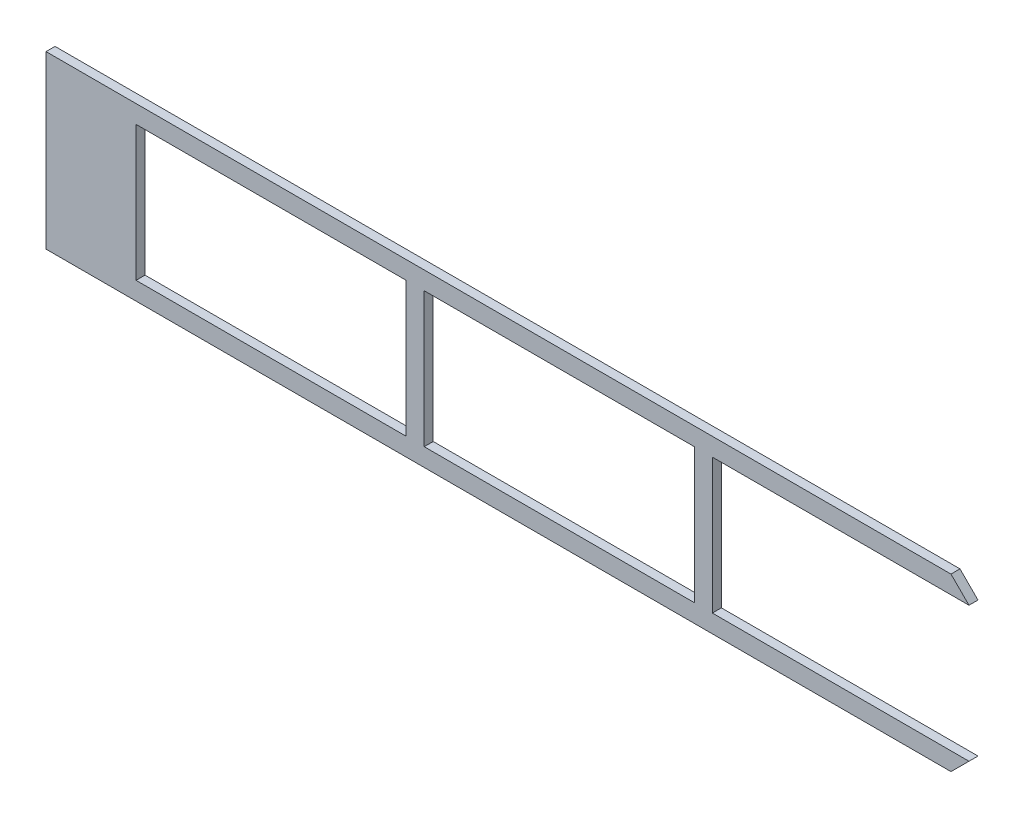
ISO-10303-21;
HEADER;
FILE_DESCRIPTION(('STEP AP214'),'2;1');
FILE_NAME('part.step','',(''),(''),'','','');
FILE_SCHEMA(('AUTOMOTIVE_DESIGN { 1 0 10303 214 1 1 1 1 }'));
ENDSEC;
DATA;
#1=APPLICATION_CONTEXT('core data for automotive mechanical design processes');
#2=APPLICATION_PROTOCOL_DEFINITION('international standard','automotive_design',2000,#1);
#3=PRODUCT_CONTEXT('',#1,'mechanical');
#4=PRODUCT('Part','Part','',(#3));
#5=PRODUCT_RELATED_PRODUCT_CATEGORY('part','',(#4));
#6=PRODUCT_DEFINITION_FORMATION('','',#4);
#7=PRODUCT_DEFINITION_CONTEXT('part definition',#1,'design');
#8=PRODUCT_DEFINITION('design','',#6,#7);
#9=PRODUCT_DEFINITION_SHAPE('','',#8);
#10=(LENGTH_UNIT() NAMED_UNIT(*) SI_UNIT(.MILLI.,.METRE.));
#11=(NAMED_UNIT(*) PLANE_ANGLE_UNIT() SI_UNIT($,.RADIAN.));
#12=(NAMED_UNIT(*) SI_UNIT($,.STERADIAN.) SOLID_ANGLE_UNIT());
#13=UNCERTAINTY_MEASURE_WITH_UNIT(LENGTH_MEASURE(1.E-05),#10,'distance_accuracy_value','');
#14=(GEOMETRIC_REPRESENTATION_CONTEXT(3) GLOBAL_UNCERTAINTY_ASSIGNED_CONTEXT((#13)) GLOBAL_UNIT_ASSIGNED_CONTEXT((#10,
#11,#12)) REPRESENTATION_CONTEXT('',''));
#15=CARTESIAN_POINT('',(0.,0.,0.));
#16=DIRECTION('',(0.,0.,1.));
#17=DIRECTION('',(1.,0.,0.));
#18=AXIS2_PLACEMENT_3D('',#15,#16,#17);
#19=CARTESIAN_POINT('',(0.,0.,1.));
#20=DIRECTION('',(0.,0.,-1.));
#21=DIRECTION('',(-1.,0.,0.));
#22=AXIS2_PLACEMENT_3D('',#19,#20,#21);
#23=PLANE('',#22);
#24=DIRECTION('',(0.,-1.,0.));
#25=VECTOR('',#24,1.);
#26=CARTESIAN_POINT('',(0.,0.,1.));
#27=LINE('',#26,#25);
#28=CARTESIAN_POINT('',(0.,15.,1.));
#29=VERTEX_POINT('',#28);
#30=CARTESIAN_POINT('',(0.,0.,1.));
#31=VERTEX_POINT('',#30);
#32=EDGE_CURVE('E186',#29,#31,#27,.T.);
#33=ORIENTED_EDGE('',*,*,#32,.F.);
#34=DIRECTION('',(-1.,0.,0.));
#35=VECTOR('',#34,1.);
#36=CARTESIAN_POINT('',(0.,15.,1.));
#37=LINE('',#36,#35);
#38=CARTESIAN_POINT('',(30.,15.,1.));
#39=VERTEX_POINT('',#38);
#40=EDGE_CURVE('E194',#39,#29,#37,.T.);
#41=ORIENTED_EDGE('',*,*,#40,.F.);
#42=DIRECTION('',(0.,1.,0.));
#43=VECTOR('',#42,1.);
#44=CARTESIAN_POINT('',(30.,0.,1.));
#45=LINE('',#44,#43);
#46=CARTESIAN_POINT('',(30.,0.,1.));
#47=VERTEX_POINT('',#46);
#48=EDGE_CURVE('E191',#47,#39,#45,.T.);
#49=ORIENTED_EDGE('',*,*,#48,.F.);
#50=DIRECTION('',(1.,0.,0.));
#51=VECTOR('',#50,1.);
#52=CARTESIAN_POINT('',(0.,0.,1.));
#53=LINE('',#52,#51);
#54=EDGE_CURVE('E188',#31,#47,#53,.T.);
#55=ORIENTED_EDGE('',*,*,#54,.F.);
#56=EDGE_LOOP('',(#33,#41,#49,#55));
#57=FACE_BOUND('',#56,.T.);
#58=DIRECTION('',(-0.70710678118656,0.707106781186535,0.));
#59=VECTOR('',#58,1.);
#60=CARTESIAN_POINT('',(90.5,17.,1.));
#61=LINE('',#60,#59);
#62=CARTESIAN_POINT('',(92.5000000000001,15.,1.));
#63=VERTEX_POINT('',#62);
#64=CARTESIAN_POINT('',(90.5,17.,1.));
#65=VERTEX_POINT('',#64);
#66=EDGE_CURVE('E217',#63,#65,#61,.T.);
#67=ORIENTED_EDGE('',*,*,#66,.T.);
#68=DIRECTION('',(-1.,0.,0.));
#69=VECTOR('',#68,1.);
#70=CARTESIAN_POINT('',(-10.,17.,1.));
#71=LINE('',#70,#69);
#72=CARTESIAN_POINT('',(-10.,17.,1.));
#73=VERTEX_POINT('',#72);
#74=EDGE_CURVE('E220',#65,#73,#71,.T.);
#75=ORIENTED_EDGE('',*,*,#74,.T.);
#76=DIRECTION('',(0.,-1.,0.));
#77=VECTOR('',#76,1.);
#78=CARTESIAN_POINT('',(-10.,-2.,1.));
#79=LINE('',#78,#77);
#80=CARTESIAN_POINT('',(-10.,-2.,1.));
#81=VERTEX_POINT('',#80);
#82=EDGE_CURVE('E223',#73,#81,#79,.T.);
#83=ORIENTED_EDGE('',*,*,#82,.T.);
#84=DIRECTION('',(1.,0.,0.));
#85=VECTOR('',#84,1.);
#86=CARTESIAN_POINT('',(90.5,-1.99999999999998,1.));
#87=LINE('',#86,#85);
#88=CARTESIAN_POINT('',(90.5,-1.99999999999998,1.));
#89=VERTEX_POINT('',#88);
#90=EDGE_CURVE('E225',#81,#89,#87,.T.);
#91=ORIENTED_EDGE('',*,*,#90,.T.);
#92=DIRECTION('',(0.707106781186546,0.707106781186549,0.));
#93=VECTOR('',#92,1.);
#94=CARTESIAN_POINT('',(92.5,0.,1.));
#95=LINE('',#94,#93);
#96=CARTESIAN_POINT('',(92.5,0.,1.));
#97=VERTEX_POINT('',#96);
#98=EDGE_CURVE('E227',#89,#97,#95,.T.);
#99=ORIENTED_EDGE('',*,*,#98,.T.);
#100=DIRECTION('',(-1.,0.,0.));
#101=VECTOR('',#100,1.);
#102=CARTESIAN_POINT('',(64.,0.,1.));
#103=LINE('',#102,#101);
#104=CARTESIAN_POINT('',(64.,0.,1.));
#105=VERTEX_POINT('',#104);
#106=EDGE_CURVE('E229',#97,#105,#103,.T.);
#107=ORIENTED_EDGE('',*,*,#106,.T.);
#108=DIRECTION('',(0.,1.,0.));
#109=VECTOR('',#108,1.);
#110=CARTESIAN_POINT('',(64.,0.,1.));
#111=LINE('',#110,#109);
#112=CARTESIAN_POINT('',(64.,15.,1.));
#113=VERTEX_POINT('',#112);
#114=EDGE_CURVE('E231',#105,#113,#111,.T.);
#115=ORIENTED_EDGE('',*,*,#114,.T.);
#116=DIRECTION('',(1.,0.,0.));
#117=VECTOR('',#116,1.);
#118=CARTESIAN_POINT('',(64.,15.,1.));
#119=LINE('',#118,#117);
#120=EDGE_CURVE('E233',#113,#63,#119,.T.);
#121=ORIENTED_EDGE('',*,*,#120,.T.);
#122=EDGE_LOOP('',(#67,#75,#83,#91,#99,#107,#115,#121));
#123=FACE_BOUND('',#122,.T.);
#124=DIRECTION('',(0.,-1.,0.));
#125=VECTOR('',#124,1.);
#126=CARTESIAN_POINT('',(32.,0.,1.));
#127=LINE('',#126,#125);
#128=CARTESIAN_POINT('',(32.,15.,1.));
#129=VERTEX_POINT('',#128);
#130=CARTESIAN_POINT('',(32.,0.,1.));
#131=VERTEX_POINT('',#130);
#132=EDGE_CURVE('E150',#129,#131,#127,.T.);
#133=ORIENTED_EDGE('',*,*,#132,.F.);
#134=DIRECTION('',(-1.,0.,0.));
#135=VECTOR('',#134,1.);
#136=CARTESIAN_POINT('',(32.,15.,1.));
#137=LINE('',#136,#135);
#138=CARTESIAN_POINT('',(62.,15.,1.));
#139=VERTEX_POINT('',#138);
#140=EDGE_CURVE('E172',#139,#129,#137,.T.);
#141=ORIENTED_EDGE('',*,*,#140,.F.);
#142=DIRECTION('',(0.,1.,0.));
#143=VECTOR('',#142,1.);
#144=CARTESIAN_POINT('',(62.,0.,1.));
#145=LINE('',#144,#143);
#146=CARTESIAN_POINT('',(62.,0.,1.));
#147=VERTEX_POINT('',#146);
#148=EDGE_CURVE('E170',#147,#139,#145,.T.);
#149=ORIENTED_EDGE('',*,*,#148,.F.);
#150=DIRECTION('',(1.,0.,0.));
#151=VECTOR('',#150,1.);
#152=CARTESIAN_POINT('',(32.,0.,1.));
#153=LINE('',#152,#151);
#154=EDGE_CURVE('E158',#131,#147,#153,.T.);
#155=ORIENTED_EDGE('',*,*,#154,.F.);
#156=EDGE_LOOP('',(#133,#141,#149,#155));
#157=FACE_BOUND('',#156,.T.);
#158=ADVANCED_FACE('F37',(#57,#123,#157),#23,.F.);
#159=CARTESIAN_POINT('',(0.,0.,0.));
#160=DIRECTION('',(0.,0.,-1.));
#161=DIRECTION('',(-1.,0.,0.));
#162=AXIS2_PLACEMENT_3D('',#159,#160,#161);
#163=PLANE('',#162);
#164=DIRECTION('',(-1.,0.,0.));
#165=VECTOR('',#164,1.);
#166=CARTESIAN_POINT('',(0.,15.,0.));
#167=LINE('',#166,#165);
#168=CARTESIAN_POINT('',(30.,15.,0.));
#169=VERTEX_POINT('',#168);
#170=CARTESIAN_POINT('',(0.,15.,0.));
#171=VERTEX_POINT('',#170);
#172=EDGE_CURVE('E189',#169,#171,#167,.T.);
#173=ORIENTED_EDGE('',*,*,#172,.T.);
#174=DIRECTION('',(0.,-1.,0.));
#175=VECTOR('',#174,1.);
#176=CARTESIAN_POINT('',(0.,0.,0.));
#177=LINE('',#176,#175);
#178=CARTESIAN_POINT('',(0.,0.,0.));
#179=VERTEX_POINT('',#178);
#180=EDGE_CURVE('E166',#171,#179,#177,.T.);
#181=ORIENTED_EDGE('',*,*,#180,.T.);
#182=DIRECTION('',(1.,0.,0.));
#183=VECTOR('',#182,1.);
#184=CARTESIAN_POINT('',(0.,0.,0.));
#185=LINE('',#184,#183);
#186=CARTESIAN_POINT('',(30.,0.,0.));
#187=VERTEX_POINT('',#186);
#188=EDGE_CURVE('E199',#179,#187,#185,.T.);
#189=ORIENTED_EDGE('',*,*,#188,.T.);
#190=DIRECTION('',(0.,1.,0.));
#191=VECTOR('',#190,1.);
#192=CARTESIAN_POINT('',(30.,0.,0.));
#193=LINE('',#192,#191);
#194=EDGE_CURVE('E202',#187,#169,#193,.T.);
#195=ORIENTED_EDGE('',*,*,#194,.T.);
#196=EDGE_LOOP('',(#173,#181,#189,#195));
#197=FACE_BOUND('',#196,.T.);
#198=DIRECTION('',(-0.70710678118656,0.707106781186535,0.));
#199=VECTOR('',#198,1.);
#200=CARTESIAN_POINT('',(90.5,17.,0.));
#201=LINE('',#200,#199);
#202=CARTESIAN_POINT('',(92.5000000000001,15.,0.));
#203=VERTEX_POINT('',#202);
#204=CARTESIAN_POINT('',(90.5,17.,0.));
#205=VERTEX_POINT('',#204);
#206=EDGE_CURVE('E216',#203,#205,#201,.T.);
#207=ORIENTED_EDGE('',*,*,#206,.F.);
#208=DIRECTION('',(1.,0.,0.));
#209=VECTOR('',#208,1.);
#210=CARTESIAN_POINT('',(64.,15.,0.));
#211=LINE('',#210,#209);
#212=CARTESIAN_POINT('',(64.,15.,0.));
#213=VERTEX_POINT('',#212);
#214=EDGE_CURVE('E221',#213,#203,#211,.T.);
#215=ORIENTED_EDGE('',*,*,#214,.F.);
#216=DIRECTION('',(0.,1.,0.));
#217=VECTOR('',#216,1.);
#218=CARTESIAN_POINT('',(64.,0.,0.));
#219=LINE('',#218,#217);
#220=CARTESIAN_POINT('',(64.,0.,0.));
#221=VERTEX_POINT('',#220);
#222=EDGE_CURVE('E248',#221,#213,#219,.T.);
#223=ORIENTED_EDGE('',*,*,#222,.F.);
#224=DIRECTION('',(-1.,0.,0.));
#225=VECTOR('',#224,1.);
#226=CARTESIAN_POINT('',(64.,0.,0.));
#227=LINE('',#226,#225);
#228=CARTESIAN_POINT('',(92.5,0.,0.));
#229=VERTEX_POINT('',#228);
#230=EDGE_CURVE('E246',#229,#221,#227,.T.);
#231=ORIENTED_EDGE('',*,*,#230,.F.);
#232=DIRECTION('',(0.707106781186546,0.707106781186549,0.));
#233=VECTOR('',#232,1.);
#234=CARTESIAN_POINT('',(92.5,0.,0.));
#235=LINE('',#234,#233);
#236=CARTESIAN_POINT('',(90.5,-1.99999999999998,0.));
#237=VERTEX_POINT('',#236);
#238=EDGE_CURVE('E244',#237,#229,#235,.T.);
#239=ORIENTED_EDGE('',*,*,#238,.F.);
#240=DIRECTION('',(1.,0.,0.));
#241=VECTOR('',#240,1.);
#242=CARTESIAN_POINT('',(90.5,-1.99999999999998,0.));
#243=LINE('',#242,#241);
#244=CARTESIAN_POINT('',(-10.,-2.,0.));
#245=VERTEX_POINT('',#244);
#246=EDGE_CURVE('E242',#245,#237,#243,.T.);
#247=ORIENTED_EDGE('',*,*,#246,.F.);
#248=DIRECTION('',(0.,-1.,0.));
#249=VECTOR('',#248,1.);
#250=CARTESIAN_POINT('',(-10.,-2.,0.));
#251=LINE('',#250,#249);
#252=CARTESIAN_POINT('',(-10.,17.,0.));
#253=VERTEX_POINT('',#252);
#254=EDGE_CURVE('E240',#253,#245,#251,.T.);
#255=ORIENTED_EDGE('',*,*,#254,.F.);
#256=DIRECTION('',(-1.,0.,0.));
#257=VECTOR('',#256,1.);
#258=CARTESIAN_POINT('',(-10.,17.,0.));
#259=LINE('',#258,#257);
#260=EDGE_CURVE('E238',#205,#253,#259,.T.);
#261=ORIENTED_EDGE('',*,*,#260,.F.);
#262=EDGE_LOOP('',(#207,#215,#223,#231,#239,#247,#255,#261));
#263=FACE_BOUND('',#262,.T.);
#264=DIRECTION('',(-1.,0.,0.));
#265=VECTOR('',#264,1.);
#266=CARTESIAN_POINT('',(32.,15.,0.));
#267=LINE('',#266,#265);
#268=CARTESIAN_POINT('',(62.,15.,0.));
#269=VERTEX_POINT('',#268);
#270=CARTESIAN_POINT('',(32.,15.,0.));
#271=VERTEX_POINT('',#270);
#272=EDGE_CURVE('E159',#269,#271,#267,.T.);
#273=ORIENTED_EDGE('',*,*,#272,.T.);
#274=DIRECTION('',(0.,-1.,0.));
#275=VECTOR('',#274,1.);
#276=CARTESIAN_POINT('',(32.,0.,0.));
#277=LINE('',#276,#275);
#278=CARTESIAN_POINT('',(32.,0.,0.));
#279=VERTEX_POINT('',#278);
#280=EDGE_CURVE('E60',#271,#279,#277,.T.);
#281=ORIENTED_EDGE('',*,*,#280,.T.);
#282=DIRECTION('',(1.,0.,0.));
#283=VECTOR('',#282,1.);
#284=CARTESIAN_POINT('',(32.,0.,0.));
#285=LINE('',#284,#283);
#286=CARTESIAN_POINT('',(62.,0.,0.));
#287=VERTEX_POINT('',#286);
#288=EDGE_CURVE('E165',#279,#287,#285,.T.);
#289=ORIENTED_EDGE('',*,*,#288,.T.);
#290=DIRECTION('',(0.,1.,0.));
#291=VECTOR('',#290,1.);
#292=CARTESIAN_POINT('',(62.,0.,0.));
#293=LINE('',#292,#291);
#294=EDGE_CURVE('E178',#287,#269,#293,.T.);
#295=ORIENTED_EDGE('',*,*,#294,.T.);
#296=EDGE_LOOP('',(#273,#281,#289,#295));
#297=FACE_BOUND('',#296,.T.);
#298=ADVANCED_FACE('F278',(#197,#263,#297),#163,.T.);
#299=CARTESIAN_POINT('',(90.5,17.,1.));
#300=DIRECTION('',(-0.707106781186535,-0.70710678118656,0.));
#301=DIRECTION('',(0.70710678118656,-0.707106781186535,0.));
#302=AXIS2_PLACEMENT_3D('',#299,#300,#301);
#303=PLANE('',#302);
#304=ORIENTED_EDGE('',*,*,#206,.T.);
#305=DIRECTION('',(0.,0.,-1.));
#306=VECTOR('',#305,1.);
#307=CARTESIAN_POINT('',(90.5,17.,1.));
#308=LINE('',#307,#306);
#309=EDGE_CURVE('E11',#65,#205,#308,.T.);
#310=ORIENTED_EDGE('',*,*,#309,.F.);
#311=ORIENTED_EDGE('',*,*,#66,.F.);
#312=DIRECTION('',(0.,0.,-1.));
#313=VECTOR('',#312,1.);
#314=CARTESIAN_POINT('',(92.5000000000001,15.,1.));
#315=LINE('',#314,#313);
#316=EDGE_CURVE('E235',#63,#203,#315,.T.);
#317=ORIENTED_EDGE('',*,*,#316,.T.);
#318=EDGE_LOOP('',(#304,#310,#311,#317));
#319=FACE_BOUND('',#318,.T.);
#320=ADVANCED_FACE('F39',(#319),#303,.F.);
#321=CARTESIAN_POINT('',(-10.,17.,1.));
#322=DIRECTION('',(0.,-1.,0.));
#323=DIRECTION('',(0.,0.,-1.));
#324=AXIS2_PLACEMENT_3D('',#321,#322,#323);
#325=PLANE('',#324);
#326=ORIENTED_EDGE('',*,*,#260,.T.);
#327=DIRECTION('',(0.,0.,-1.));
#328=VECTOR('',#327,1.);
#329=CARTESIAN_POINT('',(-10.,17.,1.));
#330=LINE('',#329,#328);
#331=EDGE_CURVE('E45',#73,#253,#330,.T.);
#332=ORIENTED_EDGE('',*,*,#331,.F.);
#333=ORIENTED_EDGE('',*,*,#74,.F.);
#334=ORIENTED_EDGE('',*,*,#309,.T.);
#335=EDGE_LOOP('',(#326,#332,#333,#334));
#336=FACE_BOUND('',#335,.T.);
#337=ADVANCED_FACE('F295',(#336),#325,.F.);
#338=CARTESIAN_POINT('',(-10.,-2.,1.));
#339=DIRECTION('',(1.,0.,0.));
#340=DIRECTION('',(0.,0.,-1.));
#341=AXIS2_PLACEMENT_3D('',#338,#339,#340);
#342=PLANE('',#341);
#343=ORIENTED_EDGE('',*,*,#254,.T.);
#344=DIRECTION('',(0.,0.,-1.));
#345=VECTOR('',#344,1.);
#346=CARTESIAN_POINT('',(-10.,-2.,1.));
#347=LINE('',#346,#345);
#348=EDGE_CURVE('E265',#81,#245,#347,.T.);
#349=ORIENTED_EDGE('',*,*,#348,.F.);
#350=ORIENTED_EDGE('',*,*,#82,.F.);
#351=ORIENTED_EDGE('',*,*,#331,.T.);
#352=EDGE_LOOP('',(#343,#349,#350,#351));
#353=FACE_BOUND('',#352,.T.);
#354=ADVANCED_FACE('F272',(#353),#342,.F.);
#355=CARTESIAN_POINT('',(90.5,-1.99999999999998,1.));
#356=DIRECTION('',(0.,1.,0.));
#357=DIRECTION('',(-1.,0.,0.));
#358=AXIS2_PLACEMENT_3D('',#355,#356,#357);
#359=PLANE('',#358);
#360=ORIENTED_EDGE('',*,*,#246,.T.);
#361=DIRECTION('',(0.,0.,-1.));
#362=VECTOR('',#361,1.);
#363=CARTESIAN_POINT('',(90.5,-1.99999999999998,1.));
#364=LINE('',#363,#362);
#365=EDGE_CURVE('E262',#89,#237,#364,.T.);
#366=ORIENTED_EDGE('',*,*,#365,.F.);
#367=ORIENTED_EDGE('',*,*,#90,.F.);
#368=ORIENTED_EDGE('',*,*,#348,.T.);
#369=EDGE_LOOP('',(#360,#366,#367,#368));
#370=FACE_BOUND('',#369,.T.);
#371=ADVANCED_FACE('F284',(#370),#359,.F.);
#372=CARTESIAN_POINT('',(92.5,0.,1.));
#373=DIRECTION('',(-0.707106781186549,0.707106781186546,0.));
#374=DIRECTION('',(-0.707106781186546,-0.707106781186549,0.));
#375=AXIS2_PLACEMENT_3D('',#372,#373,#374);
#376=PLANE('',#375);
#377=ORIENTED_EDGE('',*,*,#238,.T.);
#378=DIRECTION('',(0.,0.,-1.));
#379=VECTOR('',#378,1.);
#380=CARTESIAN_POINT('',(92.5,0.,1.));
#381=LINE('',#380,#379);
#382=EDGE_CURVE('E259',#97,#229,#381,.T.);
#383=ORIENTED_EDGE('',*,*,#382,.F.);
#384=ORIENTED_EDGE('',*,*,#98,.F.);
#385=ORIENTED_EDGE('',*,*,#365,.T.);
#386=EDGE_LOOP('',(#377,#383,#384,#385));
#387=FACE_BOUND('',#386,.T.);
#388=ADVANCED_FACE('F288',(#387),#376,.F.);
#389=CARTESIAN_POINT('',(64.,0.,1.));
#390=DIRECTION('',(0.,-1.,0.));
#391=DIRECTION('',(0.,0.,-1.));
#392=AXIS2_PLACEMENT_3D('',#389,#390,#391);
#393=PLANE('',#392);
#394=ORIENTED_EDGE('',*,*,#230,.T.);
#395=DIRECTION('',(0.,0.,-1.));
#396=VECTOR('',#395,1.);
#397=CARTESIAN_POINT('',(64.,0.,1.));
#398=LINE('',#397,#396);
#399=EDGE_CURVE('E256',#105,#221,#398,.T.);
#400=ORIENTED_EDGE('',*,*,#399,.F.);
#401=ORIENTED_EDGE('',*,*,#106,.F.);
#402=ORIENTED_EDGE('',*,*,#382,.T.);
#403=EDGE_LOOP('',(#394,#400,#401,#402));
#404=FACE_BOUND('',#403,.T.);
#405=ADVANCED_FACE('F308',(#404),#393,.F.);
#406=CARTESIAN_POINT('',(64.,0.,1.));
#407=DIRECTION('',(-1.,0.,0.));
#408=DIRECTION('',(0.,0.,1.));
#409=AXIS2_PLACEMENT_3D('',#406,#407,#408);
#410=PLANE('',#409);
#411=ORIENTED_EDGE('',*,*,#222,.T.);
#412=DIRECTION('',(0.,0.,-1.));
#413=VECTOR('',#412,1.);
#414=CARTESIAN_POINT('',(64.,15.,1.));
#415=LINE('',#414,#413);
#416=EDGE_CURVE('E253',#113,#213,#415,.T.);
#417=ORIENTED_EDGE('',*,*,#416,.F.);
#418=ORIENTED_EDGE('',*,*,#114,.F.);
#419=ORIENTED_EDGE('',*,*,#399,.T.);
#420=EDGE_LOOP('',(#411,#417,#418,#419));
#421=FACE_BOUND('',#420,.T.);
#422=ADVANCED_FACE('F306',(#421),#410,.F.);
#423=CARTESIAN_POINT('',(64.,15.,1.));
#424=DIRECTION('',(0.,1.,0.));
#425=DIRECTION('',(0.,0.,1.));
#426=AXIS2_PLACEMENT_3D('',#423,#424,#425);
#427=PLANE('',#426);
#428=ORIENTED_EDGE('',*,*,#214,.T.);
#429=ORIENTED_EDGE('',*,*,#316,.F.);
#430=ORIENTED_EDGE('',*,*,#120,.F.);
#431=ORIENTED_EDGE('',*,*,#416,.T.);
#432=EDGE_LOOP('',(#428,#429,#430,#431));
#433=FACE_BOUND('',#432,.T.);
#434=ADVANCED_FACE('F301',(#433),#427,.F.);
#435=CARTESIAN_POINT('',(0.,0.,1.));
#436=DIRECTION('',(1.,0.,0.));
#437=DIRECTION('',(0.,0.,-1.));
#438=AXIS2_PLACEMENT_3D('',#435,#436,#437);
#439=PLANE('',#438);
#440=ORIENTED_EDGE('',*,*,#180,.F.);
#441=DIRECTION('',(0.,0.,-1.));
#442=VECTOR('',#441,1.);
#443=CARTESIAN_POINT('',(0.,15.,1.));
#444=LINE('',#443,#442);
#445=EDGE_CURVE('E196',#29,#171,#444,.T.);
#446=ORIENTED_EDGE('',*,*,#445,.F.);
#447=ORIENTED_EDGE('',*,*,#32,.T.);
#448=DIRECTION('',(0.,0.,-1.));
#449=VECTOR('',#448,1.);
#450=CARTESIAN_POINT('',(0.,0.,1.));
#451=LINE('',#450,#449);
#452=EDGE_CURVE('E213',#31,#179,#451,.T.);
#453=ORIENTED_EDGE('',*,*,#452,.T.);
#454=EDGE_LOOP('',(#440,#446,#447,#453));
#455=FACE_BOUND('',#454,.T.);
#456=ADVANCED_FACE('F327',(#455),#439,.T.);
#457=CARTESIAN_POINT('',(0.,0.,1.));
#458=DIRECTION('',(0.,1.,0.));
#459=DIRECTION('',(0.,0.,1.));
#460=AXIS2_PLACEMENT_3D('',#457,#458,#459);
#461=PLANE('',#460);
#462=ORIENTED_EDGE('',*,*,#188,.F.);
#463=ORIENTED_EDGE('',*,*,#452,.F.);
#464=ORIENTED_EDGE('',*,*,#54,.T.);
#465=DIRECTION('',(0.,0.,-1.));
#466=VECTOR('',#465,1.);
#467=CARTESIAN_POINT('',(30.,0.,1.));
#468=LINE('',#467,#466);
#469=EDGE_CURVE('E211',#47,#187,#468,.T.);
#470=ORIENTED_EDGE('',*,*,#469,.T.);
#471=EDGE_LOOP('',(#462,#463,#464,#470));
#472=FACE_BOUND('',#471,.T.);
#473=ADVANCED_FACE('F334',(#472),#461,.T.);
#474=CARTESIAN_POINT('',(30.,0.,1.));
#475=DIRECTION('',(-1.,0.,0.));
#476=DIRECTION('',(0.,0.,1.));
#477=AXIS2_PLACEMENT_3D('',#474,#475,#476);
#478=PLANE('',#477);
#479=ORIENTED_EDGE('',*,*,#194,.F.);
#480=ORIENTED_EDGE('',*,*,#469,.F.);
#481=ORIENTED_EDGE('',*,*,#48,.T.);
#482=DIRECTION('',(0.,0.,-1.));
#483=VECTOR('',#482,1.);
#484=CARTESIAN_POINT('',(30.,15.,1.));
#485=LINE('',#484,#483);
#486=EDGE_CURVE('E209',#39,#169,#485,.T.);
#487=ORIENTED_EDGE('',*,*,#486,.T.);
#488=EDGE_LOOP('',(#479,#480,#481,#487));
#489=FACE_BOUND('',#488,.T.);
#490=ADVANCED_FACE('F339',(#489),#478,.T.);
#491=CARTESIAN_POINT('',(0.,15.,1.));
#492=DIRECTION('',(0.,-1.,0.));
#493=DIRECTION('',(0.,0.,-1.));
#494=AXIS2_PLACEMENT_3D('',#491,#492,#493);
#495=PLANE('',#494);
#496=ORIENTED_EDGE('',*,*,#172,.F.);
#497=ORIENTED_EDGE('',*,*,#486,.F.);
#498=ORIENTED_EDGE('',*,*,#40,.T.);
#499=ORIENTED_EDGE('',*,*,#445,.T.);
#500=EDGE_LOOP('',(#496,#497,#498,#499));
#501=FACE_BOUND('',#500,.T.);
#502=ADVANCED_FACE('F345',(#501),#495,.T.);
#503=CARTESIAN_POINT('',(32.,0.,1.));
#504=DIRECTION('',(1.,0.,0.));
#505=DIRECTION('',(0.,0.,-1.));
#506=AXIS2_PLACEMENT_3D('',#503,#504,#505);
#507=PLANE('',#506);
#508=ORIENTED_EDGE('',*,*,#280,.F.);
#509=DIRECTION('',(0.,0.,-1.));
#510=VECTOR('',#509,1.);
#511=CARTESIAN_POINT('',(32.,15.,1.));
#512=LINE('',#511,#510);
#513=EDGE_CURVE('E154',#129,#271,#512,.T.);
#514=ORIENTED_EDGE('',*,*,#513,.F.);
#515=ORIENTED_EDGE('',*,*,#132,.T.);
#516=DIRECTION('',(0.,0.,-1.));
#517=VECTOR('',#516,1.);
#518=CARTESIAN_POINT('',(32.,0.,1.));
#519=LINE('',#518,#517);
#520=EDGE_CURVE('E153',#131,#279,#519,.T.);
#521=ORIENTED_EDGE('',*,*,#520,.T.);
#522=EDGE_LOOP('',(#508,#514,#515,#521));
#523=FACE_BOUND('',#522,.T.);
#524=ADVANCED_FACE('F152',(#523),#507,.T.);
#525=CARTESIAN_POINT('',(32.,0.,1.));
#526=DIRECTION('',(0.,1.,0.));
#527=DIRECTION('',(0.,0.,1.));
#528=AXIS2_PLACEMENT_3D('',#525,#526,#527);
#529=PLANE('',#528);
#530=ORIENTED_EDGE('',*,*,#288,.F.);
#531=ORIENTED_EDGE('',*,*,#520,.F.);
#532=ORIENTED_EDGE('',*,*,#154,.T.);
#533=DIRECTION('',(0.,0.,-1.));
#534=VECTOR('',#533,1.);
#535=CARTESIAN_POINT('',(62.,0.,1.));
#536=LINE('',#535,#534);
#537=EDGE_CURVE('E167',#147,#287,#536,.T.);
#538=ORIENTED_EDGE('',*,*,#537,.T.);
#539=EDGE_LOOP('',(#530,#531,#532,#538));
#540=FACE_BOUND('',#539,.T.);
#541=ADVANCED_FACE('F162',(#540),#529,.T.);
#542=CARTESIAN_POINT('',(62.,0.,1.));
#543=DIRECTION('',(-1.,0.,0.));
#544=DIRECTION('',(0.,0.,1.));
#545=AXIS2_PLACEMENT_3D('',#542,#543,#544);
#546=PLANE('',#545);
#547=ORIENTED_EDGE('',*,*,#294,.F.);
#548=ORIENTED_EDGE('',*,*,#537,.F.);
#549=ORIENTED_EDGE('',*,*,#148,.T.);
#550=DIRECTION('',(0.,0.,-1.));
#551=VECTOR('',#550,1.);
#552=CARTESIAN_POINT('',(62.,15.,1.));
#553=LINE('',#552,#551);
#554=EDGE_CURVE('E52',#139,#269,#553,.T.);
#555=ORIENTED_EDGE('',*,*,#554,.T.);
#556=EDGE_LOOP('',(#547,#548,#549,#555));
#557=FACE_BOUND('',#556,.T.);
#558=ADVANCED_FACE('F363',(#557),#546,.T.);
#559=CARTESIAN_POINT('',(32.,15.,1.));
#560=DIRECTION('',(0.,-1.,0.));
#561=DIRECTION('',(0.,0.,-1.));
#562=AXIS2_PLACEMENT_3D('',#559,#560,#561);
#563=PLANE('',#562);
#564=ORIENTED_EDGE('',*,*,#272,.F.);
#565=ORIENTED_EDGE('',*,*,#554,.F.);
#566=ORIENTED_EDGE('',*,*,#140,.T.);
#567=ORIENTED_EDGE('',*,*,#513,.T.);
#568=EDGE_LOOP('',(#564,#565,#566,#567));
#569=FACE_BOUND('',#568,.T.);
#570=ADVANCED_FACE('F366',(#569),#563,.T.);
#571=CLOSED_SHELL('',(#158,#298,#320,#337,#354,#371,#388,#405,#422,#434,#456,#473,#490,#502,
#524,#541,#558,#570));
#572=MANIFOLD_SOLID_BREP('B2',#571);
#573=ADVANCED_BREP_SHAPE_REPRESENTATION('',(#18,#572),#14);
#574=SHAPE_DEFINITION_REPRESENTATION(#9,#573);
ENDSEC;
END-ISO-10303-21;
